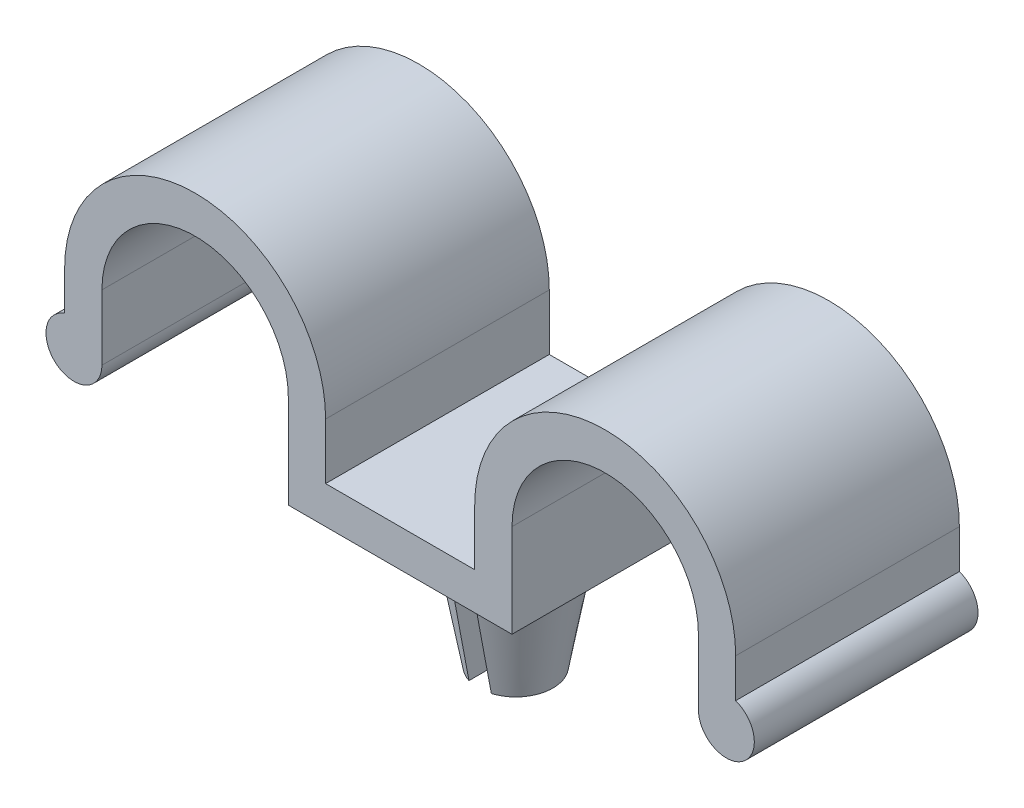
from build123d import *

# Parameters (mm, degrees)
BASE_EXTRUDE_DEPTH      = 3.81
CUT_EXTRUDE1_DEPTH      = 21.962310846
CUT_EXTRUDE1_DEPTH_BACK = 21.962310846


with BuildPart() as part:
    # Sketch1 → Base-Extrude (new, symmetric)
    with BuildSketch(Plane.XY):
        with BuildLine():
            Line((-9.525, -1.905), (-4.445, -1.905))
            Line((-4.445, -1.905), (-4.445, 0))
            ThreePointArc((-4.445, 0), (0, 4.445), (4.445, 0))
            Line((4.445, 0), (4.445, -1.324474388))
            ThreePointArc((4.445, -1.324474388), (4.677426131, -3.000212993), (3.175, -2.2225))
            Line((3.175, -2.2225), (3.175, 0))
            ThreePointArc((3.175, 0), (0, 3.175), (-3.175, 0))
            Line((-3.175, 0), (-3.175, -3.175))
            Line((-3.175, -3.175), (-10.795, -3.175))
            Line((-10.795, -3.175), (-10.795, 0))
            ThreePointArc((-10.795, 0), (-13.97, 3.175), (-17.145, 0))
            Line((-17.145, 0), (-17.145, -2.2225))
            ThreePointArc((-17.145, -2.2225), (-18.647426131, -3.000212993), (-18.415, -1.324474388))
            Line((-18.415, -1.324474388), (-18.415, 0))
            ThreePointArc((-18.415, 0), (-13.97, 4.445), (-9.525, 0))
            Line((-9.525, 0), (-9.525, -1.905))
        make_face()
    extrude(amount=BASE_EXTRUDE_DEPTH, both=True)

    # Sketch4 → Boss-Revolve1 (revolve)
    with BuildSketch(Plane.XY, mode=Mode.PRIVATE) as boss_revolve1_sk:
        Polygon((-6.858, -3.175), (-6.858, -7.874), (-5.588, -7.874), (-5.08, -5.08), (-5.08, -4.826), (-5.334, -4.826), (-5.334, -3.175), align=None)
    revolve(boss_revolve1_sk.sketch.rotate(Axis((-6.858, -3.175, 0), (0, 1, 0)), 90), axis=Axis((-6.858, -3.175, 0), (0, 1, 0)))

    # Sketch5 → Cut-Extrude1 (cut, two sides: drawn at the far end of the back side and taken through both)
    with BuildSketch(Plane.XY.offset(-CUT_EXTRUDE1_DEPTH_BACK)):
        with BuildLine():
            Line((-7.239, -7.874), (-6.477, -7.874))
            Line((-6.477, -7.874), (-6.477, -3.81))
            ThreePointArc((-6.477, -3.81), (-6.858, -3.429), (-7.239, -3.81))
            Line((-7.239, -3.81), (-7.239, -7.874))
        make_face()
    extrude(amount=CUT_EXTRUDE1_DEPTH + CUT_EXTRUDE1_DEPTH_BACK, mode=Mode.SUBTRACT)


solid = part.part
